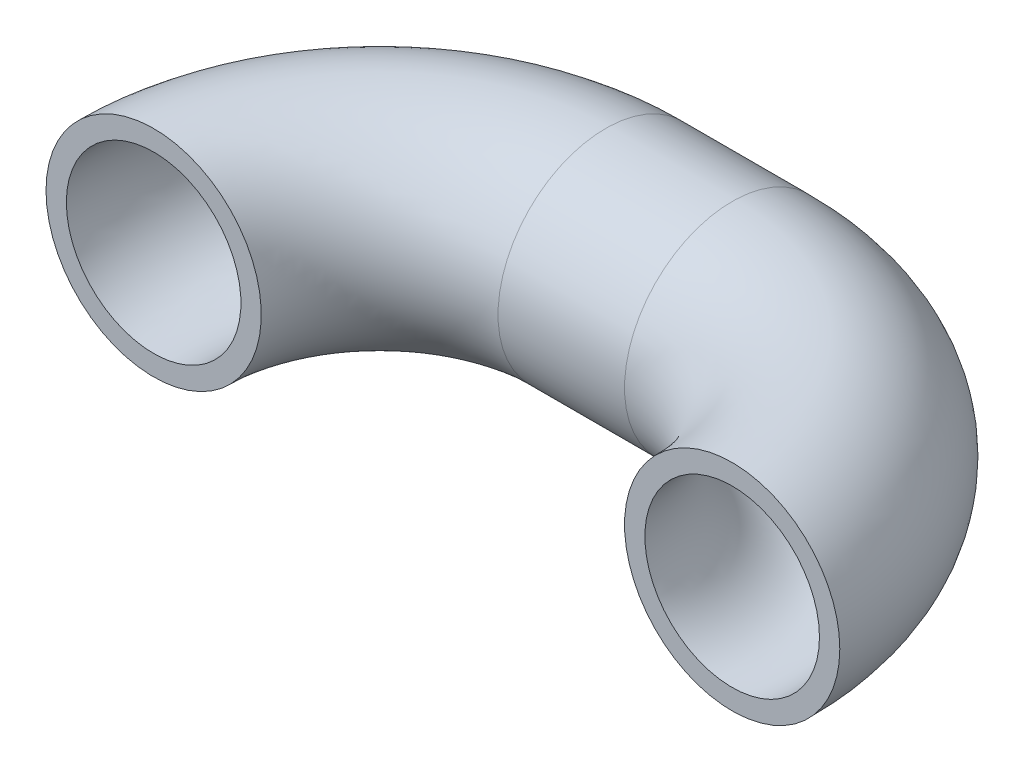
from build123d import *

# Parameters (mm, degrees)
CROQUIS1_R              = 4.7625
CROQUIS1_R_2            = 3.8625
REVOLUCI_N1_ANGLE       = 90
CROQUIS2_R              = 4.7625
CROQUIS2_R_2            = 3.8625
SALIENTE_EXTRUIR1_DEPTH = 5.5976
CROQUIS3_R              = 4.7625
CROQUIS3_R_2            = 3.8625
REVOLUCI_N2_ANGLE       = 90


with BuildPart() as part:
    # Croquis1 → Revoluci_n1 (revolve)
    with BuildSketch(Plane.XY):
        Circle(CROQUIS1_R)
        Circle(CROQUIS1_R_2, mode=Mode.SUBTRACT)
    revolve(axis=Axis((-10, 0, 0), (0, 1, 0)), revolution_arc=REVOLUCI_N1_ANGLE)

    # Croquis2 → Saliente-Extruir1 (add)
    with BuildSketch(Plane.ZY.offset(10)):
        with Locations(Location((-10, 0, 0), (0, 0, 180))):
            Circle(CROQUIS2_R)
        with Locations(Location((-10, 0, 0), (0, 0, 180))):
            Circle(CROQUIS2_R_2, mode=Mode.SUBTRACT)
    extrude(amount=SALIENTE_EXTRUIR1_DEPTH)

    # Croquis3 → Revoluci_n2 (revolve)
    with BuildSketch(Plane.XY):
        with Locations((-25.5976, 0)):
            Circle(CROQUIS3_R)
        with Locations((-25.5976, 0)):
            Circle(CROQUIS3_R_2, mode=Mode.SUBTRACT)
    revolve(axis=Axis((-15.5976, 0, 0), (0, -1, 0)), revolution_arc=REVOLUCI_N2_ANGLE)


solid = part.part
